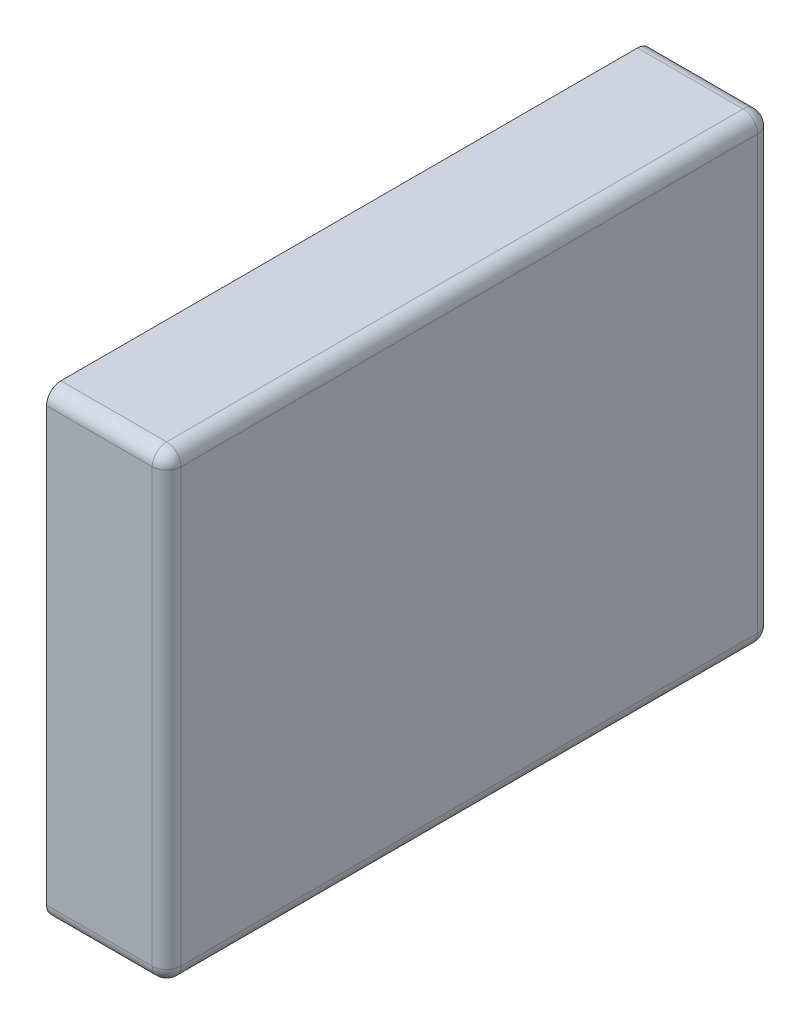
from build123d import *

# Parameters (mm, degrees)
SKETCH3_W           = 126
SKETCH3_H           = 96
BOSS_EXTRUDE3_DEPTH = 25
FILLET9_R           = 3
FILLET10_R          = 3
FILLET11_R          = 3
FILLET12_R          = 3
SKETCH5_W           = 124
SKETCH5_H           = 94
CUT_EXTRUDE4_DEPTH  = 1
SKETCH6_W           = 122
SKETCH6_H           = 92
CUT_EXTRUDE5_DEPTH  = 20
FILLET17_R          = 6
FILLET18_R          = 6
FILLET19_R          = 6
FILLET20_R          = 6
FILLET21_R          = 6
FILLET22_R          = 6
FILLET23_R          = 6
FILLET24_R          = 6


with BuildPart() as part:
    # Sketch3 → Boss-Extrude3 (new body)
    with BuildSketch(Plane(origin=(0, 0, 0), x_dir=(0, 0, -1), z_dir=(1, 0, 0))):
        Rectangle(SKETCH3_W, SKETCH3_H)
    extrude(amount=BOSS_EXTRUDE3_DEPTH)

    # Fillet9
    fillet9_edges = [part.edges().sort_by_distance(p)[0] for p in [
        (12.5, 48, 63),
    ]]
    fillet(fillet9_edges, radius=FILLET9_R)

    # Fillet10
    fillet10_edges = [part.edges().sort_by_distance(p)[0] for p in [
        (25, -1.5, 63),
        (25, 47.121320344, 62.121320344),
        (25, 48, -1.5),
    ]]
    fillet(fillet10_edges, radius=FILLET10_R)

    # Fillet11
    fillet11_edges = [part.edges().sort_by_distance(p)[0] for p in [
        (25, -48, -1.5),
        (11, -48, 63),
        (24.121320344, -48, 62.121320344),
    ]]
    fillet(fillet11_edges, radius=FILLET11_R)

    # Fillet12
    fillet12_edges = [part.edges().sort_by_distance(p)[0] for p in [
        (11, 48, -63),
        (24.121320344, 47.121320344, -63),
        (11, -48, -63),
        (25, 0, -63),
        (24.121320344, -47.121320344, -63),
    ]]
    fillet(fillet12_edges, radius=FILLET12_R)

    # Sketch5 → Cut-Extrude4 (cut)
    with BuildSketch(Plane.ZY):
        Rectangle(SKETCH5_W, SKETCH5_H)
    extrude(amount=-CUT_EXTRUDE4_DEPTH, mode=Mode.SUBTRACT)

    # Sketch6 → Cut-Extrude5 (cut)
    with BuildSketch(Plane.ZY.offset(-1)):
        Rectangle(SKETCH6_W, SKETCH6_H)
    extrude(amount=-CUT_EXTRUDE5_DEPTH, mode=Mode.SUBTRACT)

    # Fillet17
    fillet17_edges = [part.edges().sort_by_distance(p)[0] for p in [
        (11, 46, 61),
    ]]
    fillet(fillet17_edges, radius=FILLET17_R)

    # Fillet18
    fillet18_edges = [part.edges().sort_by_distance(p)[0] for p in [
        (0.5, 47, 62),
    ]]
    fillet(fillet18_edges, radius=FILLET18_R)

    # Fillet19
    fillet19_edges = [part.edges().sort_by_distance(p)[0] for p in [
        (11, 46, -61),
    ]]
    fillet(fillet19_edges, radius=FILLET19_R)

    # Fillet20
    fillet20_edges = [part.edges().sort_by_distance(p)[0] for p in [
        (0.5, 47, -62),
    ]]
    fillet(fillet20_edges, radius=FILLET20_R)

    # Fillet21
    fillet21_edges = [part.edges().sort_by_distance(p)[0] for p in [
        (11, -46, 61),
    ]]
    fillet(fillet21_edges, radius=FILLET21_R)

    # Fillet22
    fillet22_edges = [part.edges().sort_by_distance(p)[0] for p in [
        (0.5, -47, 62),
    ]]
    fillet(fillet22_edges, radius=FILLET22_R)

    # Fillet23
    fillet23_edges = [part.edges().sort_by_distance(p)[0] for p in [
        (11, -46, -61),
    ]]
    fillet(fillet23_edges, radius=FILLET23_R)

    # Fillet24
    fillet24_edges = [part.edges().sort_by_distance(p)[0] for p in [
        (0.5, -47, -62),
    ]]
    fillet(fillet24_edges, radius=FILLET24_R)


solid = part.part
